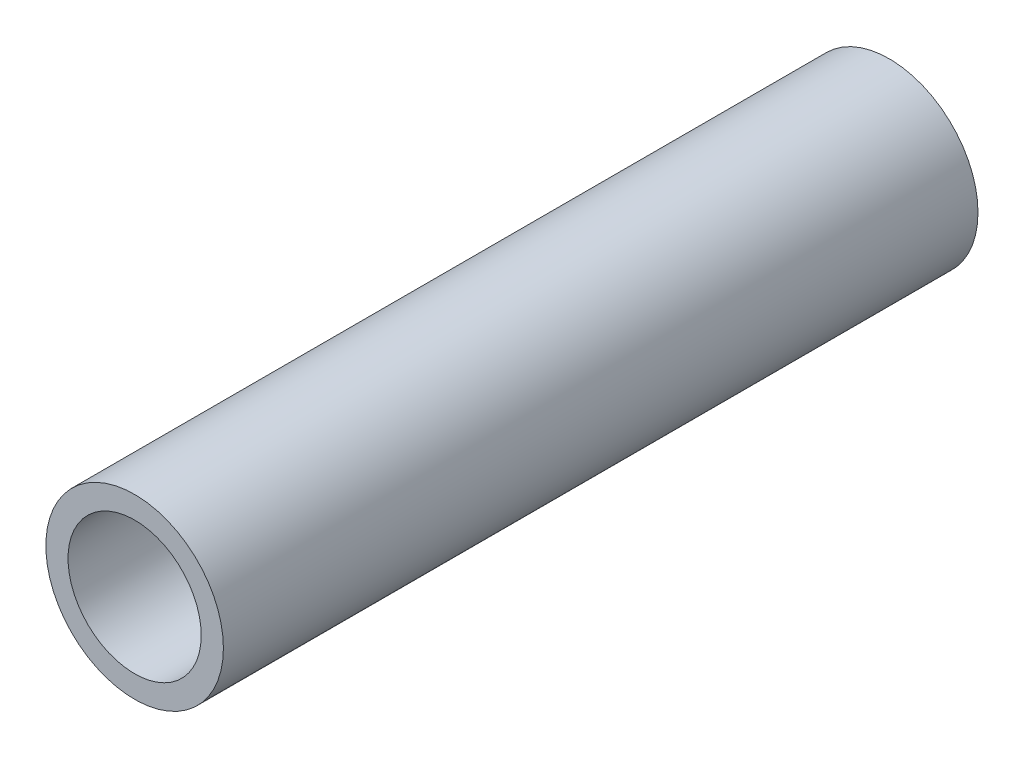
ISO-10303-21;
HEADER;
FILE_DESCRIPTION(('STEP AP214'),'2;1');
FILE_NAME('part.step','',(''),(''),'','','');
FILE_SCHEMA(('AUTOMOTIVE_DESIGN { 1 0 10303 214 1 1 1 1 }'));
ENDSEC;
DATA;
#1=APPLICATION_CONTEXT('core data for automotive mechanical design processes');
#2=APPLICATION_PROTOCOL_DEFINITION('international standard','automotive_design',2000,#1);
#3=PRODUCT_CONTEXT('',#1,'mechanical');
#4=PRODUCT('Part','Part','',(#3));
#5=PRODUCT_RELATED_PRODUCT_CATEGORY('part','',(#4));
#6=PRODUCT_DEFINITION_FORMATION('','',#4);
#7=PRODUCT_DEFINITION_CONTEXT('part definition',#1,'design');
#8=PRODUCT_DEFINITION('design','',#6,#7);
#9=PRODUCT_DEFINITION_SHAPE('','',#8);
#10=(LENGTH_UNIT() NAMED_UNIT(*) SI_UNIT(.MILLI.,.METRE.));
#11=(NAMED_UNIT(*) PLANE_ANGLE_UNIT() SI_UNIT($,.RADIAN.));
#12=(NAMED_UNIT(*) SI_UNIT($,.STERADIAN.) SOLID_ANGLE_UNIT());
#13=UNCERTAINTY_MEASURE_WITH_UNIT(LENGTH_MEASURE(1.E-05),#10,'distance_accuracy_value','');
#14=(GEOMETRIC_REPRESENTATION_CONTEXT(3) GLOBAL_UNCERTAINTY_ASSIGNED_CONTEXT((#13)) GLOBAL_UNIT_ASSIGNED_CONTEXT((#10,
#11,#12)) REPRESENTATION_CONTEXT('',''));
#15=CARTESIAN_POINT('',(0.,0.,0.));
#16=DIRECTION('',(0.,0.,1.));
#17=DIRECTION('',(1.,0.,0.));
#18=AXIS2_PLACEMENT_3D('',#15,#16,#17);
#19=CARTESIAN_POINT('',(0.,0.,34.));
#20=DIRECTION('',(0.,0.,1.));
#21=DIRECTION('',(1.,0.,0.));
#22=AXIS2_PLACEMENT_3D('',#19,#20,#21);
#23=PLANE('',#22);
#24=CARTESIAN_POINT('',(0.,0.,34.));
#25=DIRECTION('',(0.,0.,1.));
#26=DIRECTION('',(1.,0.,0.));
#27=AXIS2_PLACEMENT_3D('',#24,#25,#26);
#28=CIRCLE('',#27,4.);
#29=CARTESIAN_POINT('',(4.,0.,34.));
#30=VERTEX_POINT('',#29);
#31=EDGE_CURVE('E10',#30,#30,#28,.T.);
#32=ORIENTED_EDGE('',*,*,#31,.T.);
#33=EDGE_LOOP('',(#32));
#34=FACE_BOUND('',#33,.T.);
#35=CARTESIAN_POINT('',(0.,0.,34.));
#36=DIRECTION('',(0.,0.,1.));
#37=DIRECTION('',(1.,0.,0.));
#38=AXIS2_PLACEMENT_3D('',#35,#36,#37);
#39=CIRCLE('',#38,3.);
#40=CARTESIAN_POINT('',(3.,0.,34.));
#41=VERTEX_POINT('',#40);
#42=EDGE_CURVE('E39',#41,#41,#39,.T.);
#43=ORIENTED_EDGE('',*,*,#42,.F.);
#44=EDGE_LOOP('',(#43));
#45=FACE_BOUND('',#44,.T.);
#46=ADVANCED_FACE('F28',(#34,#45),#23,.T.);
#47=CARTESIAN_POINT('',(0.,0.,0.));
#48=DIRECTION('',(0.,0.,1.));
#49=DIRECTION('',(1.,0.,0.));
#50=AXIS2_PLACEMENT_3D('',#47,#48,#49);
#51=PLANE('',#50);
#52=CARTESIAN_POINT('',(0.,0.,0.));
#53=DIRECTION('',(0.,0.,1.));
#54=DIRECTION('',(1.,0.,0.));
#55=AXIS2_PLACEMENT_3D('',#52,#53,#54);
#56=CIRCLE('',#55,4.);
#57=CARTESIAN_POINT('',(4.,0.,0.));
#58=VERTEX_POINT('',#57);
#59=EDGE_CURVE('E35',#58,#58,#56,.T.);
#60=ORIENTED_EDGE('',*,*,#59,.F.);
#61=EDGE_LOOP('',(#60));
#62=FACE_BOUND('',#61,.T.);
#63=CARTESIAN_POINT('',(0.,0.,0.));
#64=DIRECTION('',(0.,0.,1.));
#65=DIRECTION('',(1.,0.,0.));
#66=AXIS2_PLACEMENT_3D('',#63,#64,#65);
#67=CIRCLE('',#66,3.);
#68=CARTESIAN_POINT('',(3.,0.,0.));
#69=VERTEX_POINT('',#68);
#70=EDGE_CURVE('E43',#69,#69,#67,.T.);
#71=ORIENTED_EDGE('',*,*,#70,.T.);
#72=EDGE_LOOP('',(#71));
#73=FACE_BOUND('',#72,.T.);
#74=ADVANCED_FACE('F49',(#62,#73),#51,.F.);
#75=CARTESIAN_POINT('',(0.,0.,34.));
#76=DIRECTION('',(0.,0.,-1.));
#77=DIRECTION('',(-1.,0.,0.));
#78=AXIS2_PLACEMENT_3D('',#75,#76,#77);
#79=CYLINDRICAL_SURFACE('',#78,4.);
#80=ORIENTED_EDGE('',*,*,#31,.F.);
#81=EDGE_LOOP('',(#80));
#82=FACE_BOUND('',#81,.T.);
#83=ORIENTED_EDGE('',*,*,#59,.T.);
#84=EDGE_LOOP('',(#83));
#85=FACE_BOUND('',#84,.T.);
#86=ADVANCED_FACE('F30',(#82,#85),#79,.T.);
#87=CARTESIAN_POINT('',(0.,0.,34.));
#88=DIRECTION('',(0.,0.,-1.));
#89=DIRECTION('',(-1.,0.,0.));
#90=AXIS2_PLACEMENT_3D('',#87,#88,#89);
#91=CYLINDRICAL_SURFACE('',#90,3.);
#92=ORIENTED_EDGE('',*,*,#42,.T.);
#93=EDGE_LOOP('',(#92));
#94=FACE_BOUND('',#93,.T.);
#95=ORIENTED_EDGE('',*,*,#70,.F.);
#96=EDGE_LOOP('',(#95));
#97=FACE_BOUND('',#96,.T.);
#98=ADVANCED_FACE('F51',(#94,#97),#91,.F.);
#99=CLOSED_SHELL('',(#46,#74,#86,#98));
#100=MANIFOLD_SOLID_BREP('B2',#99);
#101=ADVANCED_BREP_SHAPE_REPRESENTATION('',(#18,#100),#14);
#102=SHAPE_DEFINITION_REPRESENTATION(#9,#101);
ENDSEC;
END-ISO-10303-21;
